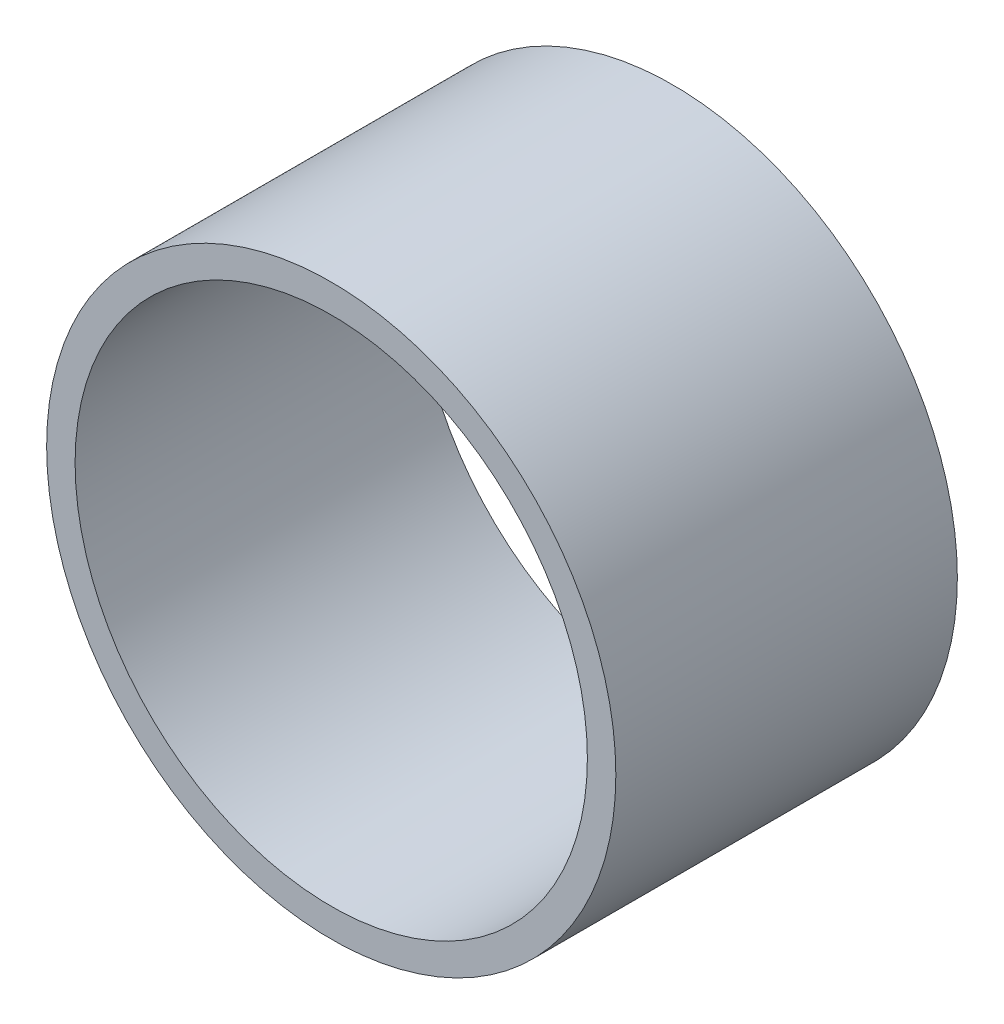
ISO-10303-21;
HEADER;
FILE_DESCRIPTION(('STEP AP214'),'2;1');
FILE_NAME('part.step','',(''),(''),'','','');
FILE_SCHEMA(('AUTOMOTIVE_DESIGN { 1 0 10303 214 1 1 1 1 }'));
ENDSEC;
DATA;
#1=APPLICATION_CONTEXT('core data for automotive mechanical design processes');
#2=APPLICATION_PROTOCOL_DEFINITION('international standard','automotive_design',2000,#1);
#3=PRODUCT_CONTEXT('',#1,'mechanical');
#4=PRODUCT('Part','Part','',(#3));
#5=PRODUCT_RELATED_PRODUCT_CATEGORY('part','',(#4));
#6=PRODUCT_DEFINITION_FORMATION('','',#4);
#7=PRODUCT_DEFINITION_CONTEXT('part definition',#1,'design');
#8=PRODUCT_DEFINITION('design','',#6,#7);
#9=PRODUCT_DEFINITION_SHAPE('','',#8);
#10=(LENGTH_UNIT() NAMED_UNIT(*) SI_UNIT(.MILLI.,.METRE.));
#11=(NAMED_UNIT(*) PLANE_ANGLE_UNIT() SI_UNIT($,.RADIAN.));
#12=(NAMED_UNIT(*) SI_UNIT($,.STERADIAN.) SOLID_ANGLE_UNIT());
#13=UNCERTAINTY_MEASURE_WITH_UNIT(LENGTH_MEASURE(1.E-05),#10,'distance_accuracy_value','');
#14=(GEOMETRIC_REPRESENTATION_CONTEXT(3) GLOBAL_UNCERTAINTY_ASSIGNED_CONTEXT((#13)) GLOBAL_UNIT_ASSIGNED_CONTEXT((#10,
#11,#12)) REPRESENTATION_CONTEXT('',''));
#15=CARTESIAN_POINT('',(0.,0.,0.));
#16=DIRECTION('',(0.,0.,1.));
#17=DIRECTION('',(1.,0.,0.));
#18=AXIS2_PLACEMENT_3D('',#15,#16,#17);
#19=CARTESIAN_POINT('',(0.,0.,300.));
#20=DIRECTION('',(0.,0.,1.));
#21=DIRECTION('',(1.,0.,0.));
#22=AXIS2_PLACEMENT_3D('',#19,#20,#21);
#23=PLANE('',#22);
#24=CARTESIAN_POINT('',(0.,0.,300.));
#25=DIRECTION('',(0.,0.,1.));
#26=DIRECTION('',(1.,0.,0.));
#27=AXIS2_PLACEMENT_3D('',#24,#25,#26);
#28=CIRCLE('',#27,250.);
#29=CARTESIAN_POINT('',(250.,0.,300.));
#30=VERTEX_POINT('',#29);
#31=EDGE_CURVE('E10',#30,#30,#28,.T.);
#32=ORIENTED_EDGE('',*,*,#31,.T.);
#33=EDGE_LOOP('',(#32));
#34=FACE_BOUND('',#33,.T.);
#35=CARTESIAN_POINT('',(0.,0.,300.));
#36=DIRECTION('',(0.,0.,1.));
#37=DIRECTION('',(1.,0.,0.));
#38=AXIS2_PLACEMENT_3D('',#35,#36,#37);
#39=CIRCLE('',#38,225.);
#40=CARTESIAN_POINT('',(225.,0.,300.));
#41=VERTEX_POINT('',#40);
#42=EDGE_CURVE('E46',#41,#41,#39,.T.);
#43=ORIENTED_EDGE('',*,*,#42,.F.);
#44=EDGE_LOOP('',(#43));
#45=FACE_BOUND('',#44,.T.);
#46=ADVANCED_FACE('F35',(#34,#45),#23,.T.);
#47=CARTESIAN_POINT('',(0.,0.,0.));
#48=DIRECTION('',(0.,0.,1.));
#49=DIRECTION('',(1.,0.,0.));
#50=AXIS2_PLACEMENT_3D('',#47,#48,#49);
#51=PLANE('',#50);
#52=CARTESIAN_POINT('',(0.,0.,0.));
#53=DIRECTION('',(0.,0.,1.));
#54=DIRECTION('',(1.,0.,0.));
#55=AXIS2_PLACEMENT_3D('',#52,#53,#54);
#56=CIRCLE('',#55,250.);
#57=CARTESIAN_POINT('',(250.,0.,0.));
#58=VERTEX_POINT('',#57);
#59=EDGE_CURVE('E39',#58,#58,#56,.T.);
#60=ORIENTED_EDGE('',*,*,#59,.F.);
#61=EDGE_LOOP('',(#60));
#62=FACE_BOUND('',#61,.T.);
#63=CARTESIAN_POINT('',(0.,0.,0.));
#64=DIRECTION('',(0.,0.,1.));
#65=DIRECTION('',(1.,0.,0.));
#66=AXIS2_PLACEMENT_3D('',#63,#64,#65);
#67=CIRCLE('',#66,225.);
#68=CARTESIAN_POINT('',(225.,0.,0.));
#69=VERTEX_POINT('',#68);
#70=EDGE_CURVE('E48',#69,#69,#67,.T.);
#71=ORIENTED_EDGE('',*,*,#70,.T.);
#72=EDGE_LOOP('',(#71));
#73=FACE_BOUND('',#72,.T.);
#74=ADVANCED_FACE('F58',(#62,#73),#51,.F.);
#75=CARTESIAN_POINT('',(0.,0.,300.));
#76=DIRECTION('',(0.,0.,-1.));
#77=DIRECTION('',(-1.,0.,0.));
#78=AXIS2_PLACEMENT_3D('',#75,#76,#77);
#79=CYLINDRICAL_SURFACE('',#78,250.);
#80=ORIENTED_EDGE('',*,*,#31,.F.);
#81=EDGE_LOOP('',(#80));
#82=FACE_BOUND('',#81,.T.);
#83=ORIENTED_EDGE('',*,*,#59,.T.);
#84=EDGE_LOOP('',(#83));
#85=FACE_BOUND('',#84,.T.);
#86=ADVANCED_FACE('F37',(#82,#85),#79,.T.);
#87=CARTESIAN_POINT('',(0.,0.,300.));
#88=DIRECTION('',(0.,0.,-1.));
#89=DIRECTION('',(-1.,0.,0.));
#90=AXIS2_PLACEMENT_3D('',#87,#88,#89);
#91=CYLINDRICAL_SURFACE('',#90,225.);
#92=ORIENTED_EDGE('',*,*,#42,.T.);
#93=EDGE_LOOP('',(#92));
#94=FACE_BOUND('',#93,.T.);
#95=ORIENTED_EDGE('',*,*,#70,.F.);
#96=EDGE_LOOP('',(#95));
#97=FACE_BOUND('',#96,.T.);
#98=ADVANCED_FACE('F54',(#94,#97),#91,.F.);
#99=CLOSED_SHELL('',(#46,#74,#86,#98));
#100=MANIFOLD_SOLID_BREP('B2',#99);
#101=ADVANCED_BREP_SHAPE_REPRESENTATION('',(#18,#100),#14);
#102=SHAPE_DEFINITION_REPRESENTATION(#9,#101);
ENDSEC;
END-ISO-10303-21;
